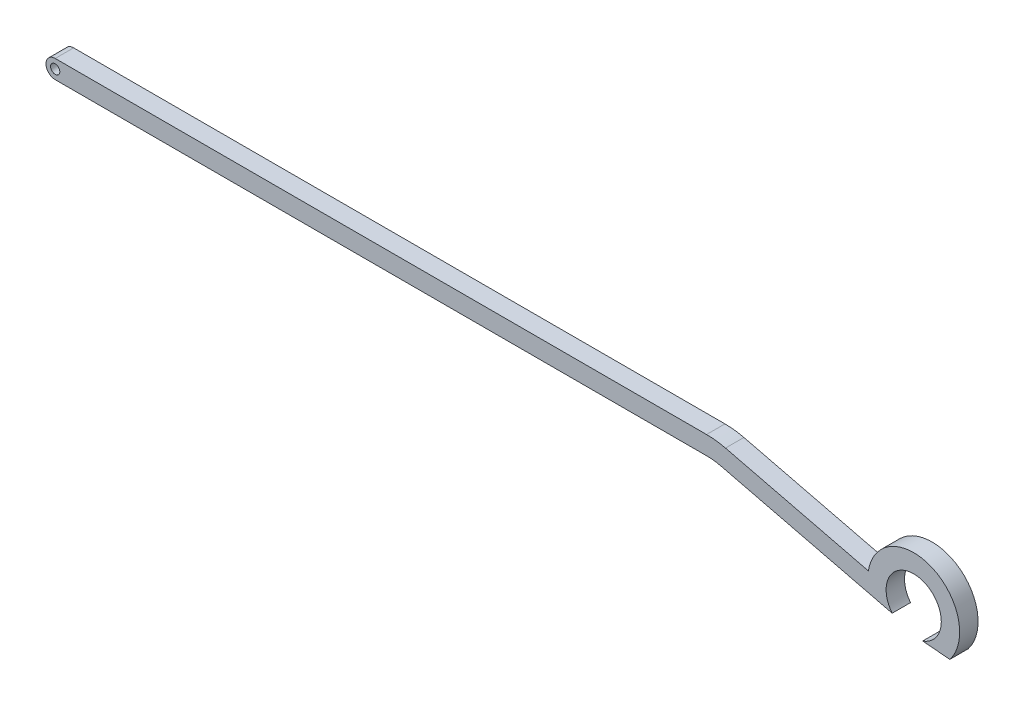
ISO-10303-21;
HEADER;
FILE_DESCRIPTION(('STEP AP214'),'2;1');
FILE_NAME('part.step','',(''),(''),'','','');
FILE_SCHEMA(('AUTOMOTIVE_DESIGN { 1 0 10303 214 1 1 1 1 }'));
ENDSEC;
DATA;
#1=APPLICATION_CONTEXT('core data for automotive mechanical design processes');
#2=APPLICATION_PROTOCOL_DEFINITION('international standard','automotive_design',2000,#1);
#3=PRODUCT_CONTEXT('',#1,'mechanical');
#4=PRODUCT('Part','Part','',(#3));
#5=PRODUCT_RELATED_PRODUCT_CATEGORY('part','',(#4));
#6=PRODUCT_DEFINITION_FORMATION('','',#4);
#7=PRODUCT_DEFINITION_CONTEXT('part definition',#1,'design');
#8=PRODUCT_DEFINITION('design','',#6,#7);
#9=PRODUCT_DEFINITION_SHAPE('','',#8);
#10=(LENGTH_UNIT() NAMED_UNIT(*) SI_UNIT(.MILLI.,.METRE.));
#11=(NAMED_UNIT(*) PLANE_ANGLE_UNIT() SI_UNIT($,.RADIAN.));
#12=(NAMED_UNIT(*) SI_UNIT($,.STERADIAN.) SOLID_ANGLE_UNIT());
#13=UNCERTAINTY_MEASURE_WITH_UNIT(LENGTH_MEASURE(1.E-05),#10,'distance_accuracy_value','');
#14=(GEOMETRIC_REPRESENTATION_CONTEXT(3) GLOBAL_UNCERTAINTY_ASSIGNED_CONTEXT((#13)) GLOBAL_UNIT_ASSIGNED_CONTEXT((#10,
#11,#12)) REPRESENTATION_CONTEXT('',''));
#15=CARTESIAN_POINT('',(0.,0.,0.));
#16=DIRECTION('',(0.,0.,1.));
#17=DIRECTION('',(1.,0.,0.));
#18=AXIS2_PLACEMENT_3D('',#15,#16,#17);
#19=CARTESIAN_POINT('',(-152.208288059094,29.4352941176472,6.00000000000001));
#20=DIRECTION('',(0.,0.,-1.));
#21=DIRECTION('',(-1.00000000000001,0.,0.));
#22=AXIS2_PLACEMENT_3D('',#19,#20,#21);
#23=CYLINDRICAL_SURFACE('',#22,2.99999999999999);
#24=CARTESIAN_POINT('',(-152.208288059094,29.4352941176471,0.));
#25=DIRECTION('',(0.,0.,1.));
#26=DIRECTION('',(1.00000000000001,0.,0.));
#27=AXIS2_PLACEMENT_3D('',#24,#25,#26);
#28=CIRCLE('',#27,2.99999999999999);
#29=CARTESIAN_POINT('',(-152.208288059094,32.4352941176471,0.));
#30=VERTEX_POINT('',#29);
#31=CARTESIAN_POINT('',(-152.208288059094,26.4352941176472,0.));
#32=VERTEX_POINT('',#31);
#33=EDGE_CURVE('E435',#30,#32,#28,.T.);
#34=ORIENTED_EDGE('',*,*,#33,.T.);
#35=DIRECTION('',(0.,0.,-1.));
#36=VECTOR('',#35,1.);
#37=CARTESIAN_POINT('',(-152.208288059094,26.4352941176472,6.00000000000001));
#38=LINE('',#37,#36);
#39=CARTESIAN_POINT('',(-152.208288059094,26.4352941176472,6.00000000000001));
#40=VERTEX_POINT('',#39);
#41=EDGE_CURVE('E11',#40,#32,#38,.T.);
#42=ORIENTED_EDGE('',*,*,#41,.F.);
#43=CARTESIAN_POINT('',(-152.208288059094,29.4352941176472,6.00000000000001));
#44=DIRECTION('',(0.,0.,1.));
#45=DIRECTION('',(1.00000000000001,0.,0.));
#46=AXIS2_PLACEMENT_3D('',#43,#44,#45);
#47=CIRCLE('',#46,2.99999999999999);
#48=CARTESIAN_POINT('',(-152.208288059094,32.4352941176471,6.00000000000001));
#49=VERTEX_POINT('',#48);
#50=EDGE_CURVE('E471',#49,#40,#47,.T.);
#51=ORIENTED_EDGE('',*,*,#50,.F.);
#52=DIRECTION('',(0.,0.,-1.));
#53=VECTOR('',#52,1.);
#54=CARTESIAN_POINT('',(-152.208288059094,32.4352941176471,6.00000000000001));
#55=LINE('',#54,#53);
#56=EDGE_CURVE('E448',#49,#30,#55,.T.);
#57=ORIENTED_EDGE('',*,*,#56,.T.);
#58=EDGE_LOOP('',(#34,#42,#51,#57));
#59=FACE_BOUND('',#58,.T.);
#60=ADVANCED_FACE('F355',(#59),#23,.T.);
#61=CARTESIAN_POINT('',(-152.208288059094,26.4352941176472,6.00000000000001));
#62=DIRECTION('',(0.,1.00000000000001,0.));
#63=DIRECTION('',(-1.00000000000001,0.,0.));
#64=AXIS2_PLACEMENT_3D('',#61,#62,#63);
#65=PLANE('',#64);
#66=DIRECTION('',(1.00000000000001,0.,0.));
#67=VECTOR('',#66,1.);
#68=CARTESIAN_POINT('',(-152.208288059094,26.4352941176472,0.));
#69=LINE('',#68,#67);
#70=CARTESIAN_POINT('',(60.2322044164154,26.4352941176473,0.));
#71=VERTEX_POINT('',#70);
#72=EDGE_CURVE('E431',#32,#71,#69,.T.);
#73=ORIENTED_EDGE('',*,*,#72,.T.);
#74=DIRECTION('',(0.,0.,-1.));
#75=VECTOR('',#74,1.);
#76=CARTESIAN_POINT('',(60.2322044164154,26.4352941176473,5.99999999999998));
#77=LINE('',#76,#75);
#78=CARTESIAN_POINT('',(60.2322044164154,26.4352941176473,5.99999999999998));
#79=VERTEX_POINT('',#78);
#80=EDGE_CURVE('E362',#79,#71,#77,.T.);
#81=ORIENTED_EDGE('',*,*,#80,.F.);
#82=DIRECTION('',(1.00000000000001,0.,0.));
#83=VECTOR('',#82,1.);
#84=CARTESIAN_POINT('',(-152.208288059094,26.4352941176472,6.00000000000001));
#85=LINE('',#84,#83);
#86=EDGE_CURVE('E444',#40,#79,#85,.T.);
#87=ORIENTED_EDGE('',*,*,#86,.F.);
#88=ORIENTED_EDGE('',*,*,#41,.T.);
#89=EDGE_LOOP('',(#73,#81,#87,#88));
#90=FACE_BOUND('',#89,.T.);
#91=ADVANCED_FACE('F443',(#90),#65,.F.);
#92=CARTESIAN_POINT('',(60.2322044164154,6.43529411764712,5.99999999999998));
#93=DIRECTION('',(0.,0.,-1.));
#94=DIRECTION('',(-1.00000000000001,0.,0.));
#95=AXIS2_PLACEMENT_3D('',#92,#93,#94);
#96=CYLINDRICAL_SURFACE('',#95,20.);
#97=CARTESIAN_POINT('',(60.2322044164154,6.43529411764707,0.));
#98=DIRECTION('',(0.,0.,-1.));
#99=DIRECTION('',(1.00000000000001,0.,0.));
#100=AXIS2_PLACEMENT_3D('',#97,#98,#99);
#101=CIRCLE('',#100,20.);
#102=CARTESIAN_POINT('',(64.9812662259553,25.8632742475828,0.));
#103=VERTEX_POINT('',#102);
#104=EDGE_CURVE('E437',#71,#103,#101,.T.);
#105=ORIENTED_EDGE('',*,*,#104,.T.);
#106=DIRECTION('',(0.,0.,-1.));
#107=VECTOR('',#106,1.);
#108=CARTESIAN_POINT('',(64.9812662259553,25.8632742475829,6.));
#109=LINE('',#108,#107);
#110=CARTESIAN_POINT('',(64.9812662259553,25.8632742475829,6.));
#111=VERTEX_POINT('',#110);
#112=EDGE_CURVE('E507',#111,#103,#109,.T.);
#113=ORIENTED_EDGE('',*,*,#112,.F.);
#114=CARTESIAN_POINT('',(60.2322044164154,6.43529411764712,5.99999999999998));
#115=DIRECTION('',(0.,0.,-1.));
#116=DIRECTION('',(1.00000000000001,0.,0.));
#117=AXIS2_PLACEMENT_3D('',#114,#115,#116);
#118=CIRCLE('',#117,20.);
#119=EDGE_CURVE('E474',#79,#111,#118,.T.);
#120=ORIENTED_EDGE('',*,*,#119,.F.);
#121=ORIENTED_EDGE('',*,*,#80,.T.);
#122=EDGE_LOOP('',(#105,#113,#120,#121));
#123=FACE_BOUND('',#122,.T.);
#124=ADVANCED_FACE('F511',(#123),#96,.F.);
#125=CARTESIAN_POINT('',(64.9812662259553,25.8632742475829,6.));
#126=DIRECTION('',(0.237453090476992,0.971399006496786,0.));
#127=DIRECTION('',(-0.971399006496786,0.237453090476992,0.));
#128=AXIS2_PLACEMENT_3D('',#125,#126,#127);
#129=PLANE('',#128);
#130=DIRECTION('',(0.971399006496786,-0.237453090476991,0.));
#131=VECTOR('',#130,1.);
#132=CARTESIAN_POINT('',(64.9812662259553,25.8632742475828,0.));
#133=LINE('',#132,#131);
#134=CARTESIAN_POINT('',(120.773854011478,12.2250861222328,0.));
#135=VERTEX_POINT('',#134);
#136=EDGE_CURVE('E457',#103,#135,#133,.T.);
#137=ORIENTED_EDGE('',*,*,#136,.T.);
#138=DIRECTION('',(0.,0.,-1.));
#139=VECTOR('',#138,1.);
#140=CARTESIAN_POINT('',(120.773854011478,12.2250861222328,6.));
#141=LINE('',#140,#139);
#142=CARTESIAN_POINT('',(120.773854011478,12.2250861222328,6.));
#143=VERTEX_POINT('',#142);
#144=EDGE_CURVE('E504',#143,#135,#141,.T.);
#145=ORIENTED_EDGE('',*,*,#144,.F.);
#146=DIRECTION('',(0.971399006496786,-0.237453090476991,0.));
#147=VECTOR('',#146,1.);
#148=CARTESIAN_POINT('',(64.9812662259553,25.8632742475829,6.));
#149=LINE('',#148,#147);
#150=EDGE_CURVE('E476',#111,#143,#149,.T.);
#151=ORIENTED_EDGE('',*,*,#150,.F.);
#152=ORIENTED_EDGE('',*,*,#112,.T.);
#153=EDGE_LOOP('',(#137,#145,#151,#152));
#154=FACE_BOUND('',#153,.T.);
#155=ADVANCED_FACE('F519',(#154),#129,.F.);
#156=CARTESIAN_POINT('',(127.791711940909,17.8597706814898,6.));
#157=DIRECTION('',(0.,0.,-1.));
#158=DIRECTION('',(-1.00000000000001,0.,0.));
#159=AXIS2_PLACEMENT_3D('',#156,#157,#158);
#160=CYLINDRICAL_SURFACE('',#159,9.);
#161=CARTESIAN_POINT('',(127.791711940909,17.8597706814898,0.));
#162=DIRECTION('',(0.,0.,-1.));
#163=DIRECTION('',(-1.00000000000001,0.,0.));
#164=AXIS2_PLACEMENT_3D('',#161,#162,#163);
#165=CIRCLE('',#164,9.);
#166=CARTESIAN_POINT('',(130.71880907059,9.34906551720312,0.));
#167=VERTEX_POINT('',#166);
#168=EDGE_CURVE('E459',#135,#167,#165,.T.);
#169=ORIENTED_EDGE('',*,*,#168,.T.);
#170=DIRECTION('',(0.,0.,-1.));
#171=VECTOR('',#170,1.);
#172=CARTESIAN_POINT('',(130.71880907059,9.3490655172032,6.));
#173=LINE('',#172,#171);
#174=CARTESIAN_POINT('',(130.71880907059,9.3490655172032,6.));
#175=VERTEX_POINT('',#174);
#176=EDGE_CURVE('E501',#175,#167,#173,.T.);
#177=ORIENTED_EDGE('',*,*,#176,.F.);
#178=CARTESIAN_POINT('',(127.791711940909,17.8597706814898,6.));
#179=DIRECTION('',(0.,0.,-1.));
#180=DIRECTION('',(-1.00000000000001,0.,0.));
#181=AXIS2_PLACEMENT_3D('',#178,#179,#180);
#182=CIRCLE('',#181,9.);
#183=EDGE_CURVE('E478',#143,#175,#182,.T.);
#184=ORIENTED_EDGE('',*,*,#183,.F.);
#185=ORIENTED_EDGE('',*,*,#144,.T.);
#186=EDGE_LOOP('',(#169,#177,#184,#185));
#187=FACE_BOUND('',#186,.T.);
#188=ADVANCED_FACE('F522',(#187),#160,.F.);
#189=CARTESIAN_POINT('',(130.71880907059,9.3490655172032,6.));
#190=DIRECTION('',(0.0870358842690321,0.996205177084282,0.));
#191=DIRECTION('',(-0.996205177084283,0.0870358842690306,0.));
#192=AXIS2_PLACEMENT_3D('',#189,#190,#191);
#193=PLANE('',#192);
#194=DIRECTION('',(0.996205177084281,-0.0870358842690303,0.));
#195=VECTOR('',#194,1.);
#196=CARTESIAN_POINT('',(130.71880907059,9.34906551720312,0.));
#197=LINE('',#196,#195);
#198=CARTESIAN_POINT('',(139.573139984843,8.57548539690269,0.));
#199=VERTEX_POINT('',#198);
#200=EDGE_CURVE('E461',#167,#199,#197,.T.);
#201=ORIENTED_EDGE('',*,*,#200,.T.);
#202=DIRECTION('',(0.,0.,-1.));
#203=VECTOR('',#202,1.);
#204=CARTESIAN_POINT('',(139.573139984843,8.5754853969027,6.));
#205=LINE('',#204,#203);
#206=CARTESIAN_POINT('',(139.573139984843,8.5754853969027,6.));
#207=VERTEX_POINT('',#206);
#208=EDGE_CURVE('E498',#207,#199,#205,.T.);
#209=ORIENTED_EDGE('',*,*,#208,.F.);
#210=DIRECTION('',(0.996205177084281,-0.0870358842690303,0.));
#211=VECTOR('',#210,1.);
#212=CARTESIAN_POINT('',(130.71880907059,9.3490655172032,6.));
#213=LINE('',#212,#211);
#214=EDGE_CURVE('E480',#175,#207,#213,.T.);
#215=ORIENTED_EDGE('',*,*,#214,.F.);
#216=ORIENTED_EDGE('',*,*,#176,.T.);
#217=EDGE_LOOP('',(#201,#209,#215,#216));
#218=FACE_BOUND('',#217,.T.);
#219=ADVANCED_FACE('F527',(#218),#193,.F.);
#220=CARTESIAN_POINT('',(127.791711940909,17.8597706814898,6.));
#221=DIRECTION('',(0.,0.,-1.));
#222=DIRECTION('',(-1.00000000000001,0.,0.));
#223=AXIS2_PLACEMENT_3D('',#220,#221,#222);
#224=CYLINDRICAL_SURFACE('',#223,15.);
#225=CARTESIAN_POINT('',(127.791711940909,17.8597706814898,0.));
#226=DIRECTION('',(0.,0.,1.));
#227=DIRECTION('',(-1.00000000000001,0.,0.));
#228=AXIS2_PLACEMENT_3D('',#225,#226,#227);
#229=CIRCLE('',#228,15.);
#230=CARTESIAN_POINT('',(112.992182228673,20.30393112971,0.));
#231=VERTEX_POINT('',#230);
#232=EDGE_CURVE('E463',#199,#231,#229,.T.);
#233=ORIENTED_EDGE('',*,*,#232,.T.);
#234=DIRECTION('',(0.,0.,-1.));
#235=VECTOR('',#234,1.);
#236=CARTESIAN_POINT('',(112.992182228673,20.30393112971,5.99999999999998));
#237=LINE('',#236,#235);
#238=CARTESIAN_POINT('',(112.992182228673,20.30393112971,5.99999999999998));
#239=VERTEX_POINT('',#238);
#240=EDGE_CURVE('E495',#239,#231,#237,.T.);
#241=ORIENTED_EDGE('',*,*,#240,.F.);
#242=CARTESIAN_POINT('',(127.791711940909,17.8597706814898,6.));
#243=DIRECTION('',(0.,0.,1.));
#244=DIRECTION('',(-1.00000000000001,0.,0.));
#245=AXIS2_PLACEMENT_3D('',#242,#243,#244);
#246=CIRCLE('',#245,15.);
#247=EDGE_CURVE('E482',#207,#239,#246,.T.);
#248=ORIENTED_EDGE('',*,*,#247,.F.);
#249=ORIENTED_EDGE('',*,*,#208,.T.);
#250=EDGE_LOOP('',(#233,#241,#248,#249));
#251=FACE_BOUND('',#250,.T.);
#252=ADVANCED_FACE('F533',(#251),#224,.T.);
#253=CARTESIAN_POINT('',(66.4059847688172,31.6916682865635,6.));
#254=DIRECTION('',(-0.237453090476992,-0.971399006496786,0.));
#255=DIRECTION('',(0.971399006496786,-0.237453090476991,0.));
#256=AXIS2_PLACEMENT_3D('',#253,#254,#255);
#257=PLANE('',#256);
#258=DIRECTION('',(-0.971399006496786,0.237453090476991,0.));
#259=VECTOR('',#258,1.);
#260=CARTESIAN_POINT('',(66.4059847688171,31.6916682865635,0.));
#261=LINE('',#260,#259);
#262=CARTESIAN_POINT('',(66.4059847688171,31.6916682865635,0.));
#263=VERTEX_POINT('',#262);
#264=EDGE_CURVE('E465',#231,#263,#261,.T.);
#265=ORIENTED_EDGE('',*,*,#264,.T.);
#266=DIRECTION('',(0.,0.,-1.));
#267=VECTOR('',#266,1.);
#268=CARTESIAN_POINT('',(66.4059847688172,31.6916682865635,6.));
#269=LINE('',#268,#267);
#270=CARTESIAN_POINT('',(66.4059847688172,31.6916682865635,6.));
#271=VERTEX_POINT('',#270);
#272=EDGE_CURVE('E492',#271,#263,#269,.T.);
#273=ORIENTED_EDGE('',*,*,#272,.F.);
#274=DIRECTION('',(-0.971399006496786,0.237453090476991,0.));
#275=VECTOR('',#274,1.);
#276=CARTESIAN_POINT('',(66.4059847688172,31.6916682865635,6.));
#277=LINE('',#276,#275);
#278=EDGE_CURVE('E484',#239,#271,#277,.T.);
#279=ORIENTED_EDGE('',*,*,#278,.F.);
#280=ORIENTED_EDGE('',*,*,#240,.T.);
#281=EDGE_LOOP('',(#265,#273,#279,#280));
#282=FACE_BOUND('',#281,.T.);
#283=ADVANCED_FACE('F537',(#282),#257,.F.);
#284=CARTESIAN_POINT('',(60.2322044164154,6.43529411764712,5.99999999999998));
#285=DIRECTION('',(0.,0.,-1.));
#286=DIRECTION('',(-1.00000000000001,0.,0.));
#287=AXIS2_PLACEMENT_3D('',#284,#285,#286);
#288=CYLINDRICAL_SURFACE('',#287,26.);
#289=CARTESIAN_POINT('',(60.2322044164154,6.43529411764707,0.));
#290=DIRECTION('',(0.,0.,1.));
#291=DIRECTION('',(1.00000000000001,0.,0.));
#292=AXIS2_PLACEMENT_3D('',#289,#290,#291);
#293=CIRCLE('',#292,26.);
#294=CARTESIAN_POINT('',(60.2322044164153,32.4352941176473,0.));
#295=VERTEX_POINT('',#294);
#296=EDGE_CURVE('E467',#263,#295,#293,.T.);
#297=ORIENTED_EDGE('',*,*,#296,.T.);
#298=DIRECTION('',(0.,0.,-1.));
#299=VECTOR('',#298,1.);
#300=CARTESIAN_POINT('',(60.2322044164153,32.4352941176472,6.));
#301=LINE('',#300,#299);
#302=CARTESIAN_POINT('',(60.2322044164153,32.4352941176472,6.));
#303=VERTEX_POINT('',#302);
#304=EDGE_CURVE('E489',#303,#295,#301,.T.);
#305=ORIENTED_EDGE('',*,*,#304,.F.);
#306=CARTESIAN_POINT('',(60.2322044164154,6.43529411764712,5.99999999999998));
#307=DIRECTION('',(0.,0.,1.));
#308=DIRECTION('',(1.00000000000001,0.,0.));
#309=AXIS2_PLACEMENT_3D('',#306,#307,#308);
#310=CIRCLE('',#309,26.);
#311=EDGE_CURVE('E374',#271,#303,#310,.T.);
#312=ORIENTED_EDGE('',*,*,#311,.F.);
#313=ORIENTED_EDGE('',*,*,#272,.T.);
#314=EDGE_LOOP('',(#297,#305,#312,#313));
#315=FACE_BOUND('',#314,.T.);
#316=ADVANCED_FACE('F540',(#315),#288,.T.);
#317=CARTESIAN_POINT('',(-152.208288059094,32.4352941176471,6.00000000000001));
#318=DIRECTION('',(0.,-1.00000000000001,0.));
#319=DIRECTION('',(0.,0.,-1.));
#320=AXIS2_PLACEMENT_3D('',#317,#318,#319);
#321=PLANE('',#320);
#322=DIRECTION('',(-1.00000000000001,0.,0.));
#323=VECTOR('',#322,1.);
#324=CARTESIAN_POINT('',(-152.208288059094,32.4352941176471,0.));
#325=LINE('',#324,#323);
#326=EDGE_CURVE('E469',#295,#30,#325,.T.);
#327=ORIENTED_EDGE('',*,*,#326,.T.);
#328=ORIENTED_EDGE('',*,*,#56,.F.);
#329=DIRECTION('',(-1.00000000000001,0.,0.));
#330=VECTOR('',#329,1.);
#331=CARTESIAN_POINT('',(-152.208288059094,32.4352941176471,6.00000000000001));
#332=LINE('',#331,#330);
#333=EDGE_CURVE('E369',#303,#49,#332,.T.);
#334=ORIENTED_EDGE('',*,*,#333,.F.);
#335=ORIENTED_EDGE('',*,*,#304,.T.);
#336=EDGE_LOOP('',(#327,#328,#334,#335));
#337=FACE_BOUND('',#336,.T.);
#338=ADVANCED_FACE('F542',(#337),#321,.F.);
#339=CARTESIAN_POINT('',(-152.208288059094,29.4352941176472,6.00000000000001));
#340=DIRECTION('',(0.,0.,1.));
#341=DIRECTION('',(1.00000000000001,0.,0.));
#342=AXIS2_PLACEMENT_3D('',#339,#340,#341);
#343=PLANE('',#342);
#344=CARTESIAN_POINT('',(-152.208288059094,29.4352941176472,6.00000000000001));
#345=DIRECTION('',(0.,0.,1.));
#346=DIRECTION('',(1.00000000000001,0.,0.));
#347=AXIS2_PLACEMENT_3D('',#344,#345,#346);
#348=CIRCLE('',#347,1.5);
#349=CARTESIAN_POINT('',(-150.708288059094,29.4352941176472,6.00000000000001));
#350=VERTEX_POINT('',#349);
#351=EDGE_CURVE('E452',#350,#350,#348,.T.);
#352=ORIENTED_EDGE('',*,*,#351,.F.);
#353=EDGE_LOOP('',(#352));
#354=FACE_BOUND('',#353,.T.);
#355=ORIENTED_EDGE('',*,*,#50,.T.);
#356=ORIENTED_EDGE('',*,*,#86,.T.);
#357=ORIENTED_EDGE('',*,*,#119,.T.);
#358=ORIENTED_EDGE('',*,*,#150,.T.);
#359=ORIENTED_EDGE('',*,*,#183,.T.);
#360=ORIENTED_EDGE('',*,*,#214,.T.);
#361=ORIENTED_EDGE('',*,*,#247,.T.);
#362=ORIENTED_EDGE('',*,*,#278,.T.);
#363=ORIENTED_EDGE('',*,*,#311,.T.);
#364=ORIENTED_EDGE('',*,*,#333,.T.);
#365=EDGE_LOOP('',(#355,#356,#357,#358,#359,#360,#361,#362,#363,#364));
#366=FACE_BOUND('',#365,.T.);
#367=ADVANCED_FACE('F514',(#354,#366),#343,.T.);
#368=CARTESIAN_POINT('',(-152.208288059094,29.4352941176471,0.));
#369=DIRECTION('',(0.,0.,1.));
#370=DIRECTION('',(1.00000000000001,0.,0.));
#371=AXIS2_PLACEMENT_3D('',#368,#369,#370);
#372=PLANE('',#371);
#373=CARTESIAN_POINT('',(-152.208288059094,29.4352941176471,0.));
#374=DIRECTION('',(0.,0.,1.));
#375=DIRECTION('',(1.00000000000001,0.,0.));
#376=AXIS2_PLACEMENT_3D('',#373,#374,#375);
#377=CIRCLE('',#376,1.5);
#378=CARTESIAN_POINT('',(-150.708288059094,29.4352941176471,0.));
#379=VERTEX_POINT('',#378);
#380=EDGE_CURVE('E449',#379,#379,#377,.T.);
#381=ORIENTED_EDGE('',*,*,#380,.T.);
#382=EDGE_LOOP('',(#381));
#383=FACE_BOUND('',#382,.T.);
#384=ORIENTED_EDGE('',*,*,#33,.F.);
#385=ORIENTED_EDGE('',*,*,#326,.F.);
#386=ORIENTED_EDGE('',*,*,#296,.F.);
#387=ORIENTED_EDGE('',*,*,#264,.F.);
#388=ORIENTED_EDGE('',*,*,#232,.F.);
#389=ORIENTED_EDGE('',*,*,#200,.F.);
#390=ORIENTED_EDGE('',*,*,#168,.F.);
#391=ORIENTED_EDGE('',*,*,#136,.F.);
#392=ORIENTED_EDGE('',*,*,#104,.F.);
#393=ORIENTED_EDGE('',*,*,#72,.F.);
#394=EDGE_LOOP('',(#384,#385,#386,#387,#388,#389,#390,#391,#392,#393));
#395=FACE_BOUND('',#394,.T.);
#396=ADVANCED_FACE('F432',(#383,#395),#372,.F.);
#397=CARTESIAN_POINT('',(-152.208288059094,29.4352941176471,0.));
#398=DIRECTION('',(0.,0.,1.));
#399=DIRECTION('',(1.00000000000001,0.,0.));
#400=AXIS2_PLACEMENT_3D('',#397,#398,#399);
#401=CYLINDRICAL_SURFACE('',#400,1.5);
#402=ORIENTED_EDGE('',*,*,#380,.F.);
#403=EDGE_LOOP('',(#402));
#404=FACE_BOUND('',#403,.T.);
#405=ORIENTED_EDGE('',*,*,#351,.T.);
#406=EDGE_LOOP('',(#405));
#407=FACE_BOUND('',#406,.T.);
#408=ADVANCED_FACE('F591',(#404,#407),#401,.F.);
#409=CLOSED_SHELL('',(#60,#91,#124,#155,#188,#219,#252,#283,#316,#338,#367,#396,#408));
#410=MANIFOLD_SOLID_BREP('B2',#409);
#411=ADVANCED_BREP_SHAPE_REPRESENTATION('',(#18,#410),#14);
#412=SHAPE_DEFINITION_REPRESENTATION(#9,#411);
ENDSEC;
END-ISO-10303-21;
